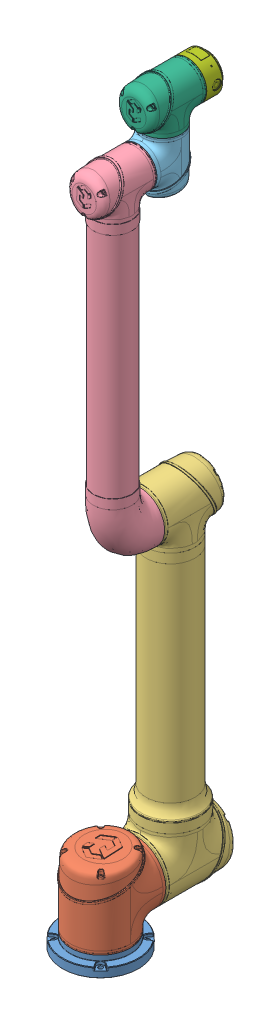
SolidWorks assembly EA64-13拖动模型.SLDASM, configuration 默认 (file format 10000). Lengths in mm.
Overall size (212.13 1435.6 320.14).
7 component instances, 7 part files, 12 mates.
Components (placement in the parent):
- EA64-13-Base-1: EA64-13-Base.SLDPRT [Default] at (-102.997 0 70.8231) x (0.707107 0 0.707107) z (-0.707107 0 0.707107) size (150 28 150)
- EA64-13-link1-1: EA64-13-link1.SLDPRT [Default] at (-187.712 77.4633 209.7562) x (0 0 -1) z (1 0 0) size (133.43 144.08 139.06)
- EA64-13-LINK2-1: EA64-13-LINK2.SLDPRT [Default] at (-216.0595 208.8864 -165.6215) x (0 0 1) z (-1 0 0) size (144.08 711.77 139.06)
- EA64-13-LINK3-1: EA64-13-LINK3.SLDPRT [Default] at (-201.0071 472.0144 13.4014) x (0 0 1) z (1 0 0) size (112.38 690.84 101.9)
- EA64-13-LINK4-1: EA64-13-LINK4.SLDPRT [Default] at (-187.712 1438.2524 -12.708) x (0 0 1) z (1 0 0) size (88.11 107.88 91.48)
- EA64-13-LINK5-1: EA64-13-LINK5.SLDPRT [Default] at (-187.712 1506.3257 -42.6347) x (0 -1 0) z (-1 0 0) size (88.11 107.88 91.48)
- EA64-13-LINK6-1: EA64-13-LINK6.SLDPRT [Default] at (-187.712 1430.564 -109.9268) x (0 1 0) z (1 0 0) size (76 39.5 76)
Mates (geometry in assembly coordinates):
- 同心1: concentric aligned: cylinder of EA64-13-Base-1 through (-187.712 92.0795 155.5382) axis (0 -1 0) radius 59; cylinder of EA64-13-link1-1 through (-187.712 102.0795 155.5382) axis (0 -1 0) radius 5
- 重合1: coincident anti-aligned: plane of EA64-13-Base-1 through (-187.712 92.0795 155.5382) normal (0 1 0); plane of EA64-13-link1-1 through (-187.712 92.0795 155.5382) normal (0 -1 0)
- 同心2: concentric anti-aligned: cylinder of EA64-13-LINK2-1 through (-187.712 160.0795 75.5382) axis (0 0 1) radius 3.6161; cylinder of EA64-13-link1-1 through (-187.712 160.0795 95.5382) axis (0 0 -1) radius 5
- 重合2: coincident anti-aligned: plane of EA64-13-LINK2-1 through (-187.712 160.0795 85.5382) normal (0 0 1); plane of EA64-13-link1-1 through (-187.712 160.0795 85.5382) normal (0 0 -1)
- 重合3: coincident anti-aligned: plane of EA64-13-LINK2-1 through (-187.712 762.0795 77.5382) normal (0 0 1); plane of EA64-13-LINK3-1 through (-187.712 762.0795 77.5382) normal (0 0 -1)
- 同心3: concentric anti-aligned: cylinder of EA64-13-LINK3-1 through (-187.712 762.0795 87.5382) axis (0 0 -1) radius 3.2744; cylinder of EA64-13-LINK2-1 through (-187.712 762.0795 67.5382) axis (0 0 1) radius 4.4622
- 同心4: concentric anti-aligned: cylinder of EA64-13-LINK4-1 through (-187.712 1362.0795 72.0382) axis (0 0 1) radius 4.2907; cylinder of EA64-13-LINK3-1 through (-187.712 1362.0795 92.0382) axis (0 0 -1) radius 5
- 重合4: coincident anti-aligned: plane of EA64-13-LINK4-1 through (-187.712 1362.0795 82.0382) normal (0 0 1); plane of EA64-13-LINK3-1 through (-187.712 1362.0795 82.0382) normal (0 0 -1)
- 同心5: concentric anti-aligned: cylinder of EA64-13-LINK5-1 through (-187.712 1421.5795 33.5382) axis (0 -1 0) radius 4.2907; cylinder of EA64-13-LINK4-1 through (-187.712 1401.5795 33.5382) axis (0 1 0) radius 4.3845
- 重合5: coincident anti-aligned: plane of EA64-13-LINK5-1; plane of EA64-13-LINK4-1
- 同心6: concentric anti-aligned: cylinder of EA64-13-LINK5-1 through (-187.712 1460.0795 -5.9618) axis (0 0 -1) radius 4.3845; cylinder of EA64-13-LINK6-1 through (-187.712 1460.0795 -49.4618) axis (0 0 1) radius 38
- 重合6: coincident anti-aligned: plane of EA64-13-LINK6-1 through (-187.712 1460.0795 -15.9618) normal (0 0 1); plane of EA64-13-LINK5-1 through (-187.712 1460.0795 -15.9618) normal (0 0 -1)
